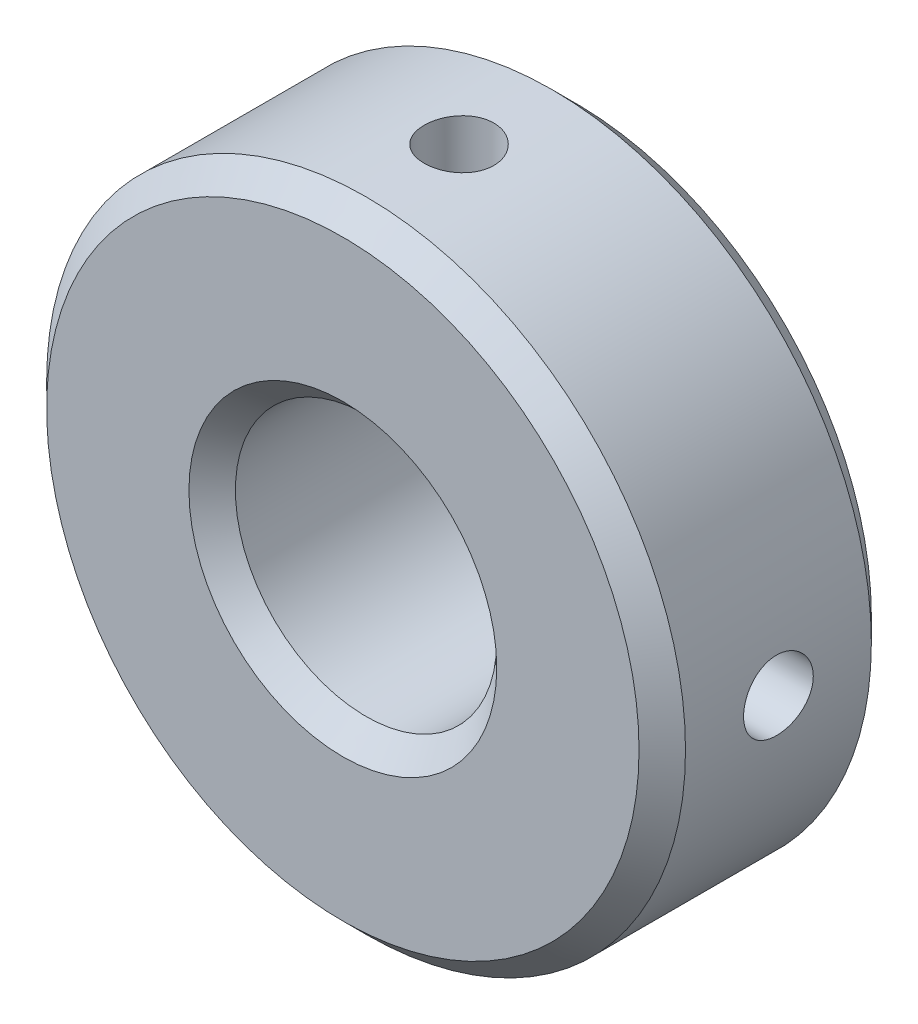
ISO-10303-21;
HEADER;
FILE_DESCRIPTION(('STEP AP214'),'2;1');
FILE_NAME('part.step','',(''),(''),'','','');
FILE_SCHEMA(('AUTOMOTIVE_DESIGN { 1 0 10303 214 1 1 1 1 }'));
ENDSEC;
DATA;
#1=APPLICATION_CONTEXT('core data for automotive mechanical design processes');
#2=APPLICATION_PROTOCOL_DEFINITION('international standard','automotive_design',2000,#1);
#3=PRODUCT_CONTEXT('',#1,'mechanical');
#4=PRODUCT('Part','Part','',(#3));
#5=PRODUCT_RELATED_PRODUCT_CATEGORY('part','',(#4));
#6=PRODUCT_DEFINITION_FORMATION('','',#4);
#7=PRODUCT_DEFINITION_CONTEXT('part definition',#1,'design');
#8=PRODUCT_DEFINITION('design','',#6,#7);
#9=PRODUCT_DEFINITION_SHAPE('','',#8);
#10=(LENGTH_UNIT() NAMED_UNIT(*) SI_UNIT(.MILLI.,.METRE.));
#11=(NAMED_UNIT(*) PLANE_ANGLE_UNIT() SI_UNIT($,.RADIAN.));
#12=(NAMED_UNIT(*) SI_UNIT($,.STERADIAN.) SOLID_ANGLE_UNIT());
#13=UNCERTAINTY_MEASURE_WITH_UNIT(LENGTH_MEASURE(1.E-05),#10,'distance_accuracy_value','');
#14=(GEOMETRIC_REPRESENTATION_CONTEXT(3) GLOBAL_UNCERTAINTY_ASSIGNED_CONTEXT((#13)) GLOBAL_UNIT_ASSIGNED_CONTEXT((#10,
#11,#12)) REPRESENTATION_CONTEXT('',''));
#15=CARTESIAN_POINT('',(0.,0.,0.));
#16=DIRECTION('',(0.,0.,1.));
#17=DIRECTION('',(1.,0.,0.));
#18=AXIS2_PLACEMENT_3D('',#15,#16,#17);
#19=CARTESIAN_POINT('',(0.,0.,-4.));
#20=DIRECTION('',(0.,0.,1.));
#21=DIRECTION('',(1.,0.,0.));
#22=AXIS2_PLACEMENT_3D('',#19,#20,#21);
#23=CYLINDRICAL_SURFACE('',#22,11.);
#24=CARTESIAN_POINT('',(0.,0.,-3.2));
#25=DIRECTION('',(0.,0.,1.));
#26=DIRECTION('',(1.,0.,0.));
#27=AXIS2_PLACEMENT_3D('',#24,#25,#26);
#28=CIRCLE('',#27,11.);
#29=CARTESIAN_POINT('',(11.,0.,-3.2));
#30=VERTEX_POINT('',#29);
#31=EDGE_CURVE('E163',#30,#30,#28,.T.);
#32=ORIENTED_EDGE('',*,*,#31,.T.);
#33=EDGE_LOOP('',(#32));
#34=FACE_BOUND('',#33,.T.);
#35=CARTESIAN_POINT('',(0.,0.,3.2));
#36=DIRECTION('',(0.,0.,1.));
#37=DIRECTION('',(1.,0.,0.));
#38=AXIS2_PLACEMENT_3D('',#35,#36,#37);
#39=CIRCLE('',#38,11.);
#40=CARTESIAN_POINT('',(11.,0.,3.2));
#41=VERTEX_POINT('',#40);
#42=EDGE_CURVE('E155',#41,#41,#39,.F.);
#43=ORIENTED_EDGE('',*,*,#42,.T.);
#44=EDGE_LOOP('',(#43));
#45=FACE_BOUND('',#44,.T.);
#46=CARTESIAN_POINT('',(0.,11.,1.2001011));
#47=CARTESIAN_POINT('',(-0.0671959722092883,10.9999991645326,1.20009820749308));
#48=CARTESIAN_POINT('',(-0.134435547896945,10.9993777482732,1.1944384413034));
#49=CARTESIAN_POINT('',(-0.26704821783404,10.9969585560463,1.17194728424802));
#50=CARTESIAN_POINT('',(-0.332419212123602,10.9951595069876,1.15510380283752));
#51=CARTESIAN_POINT('',(-0.459355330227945,10.9905879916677,1.11074342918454));
#52=CARTESIAN_POINT('',(-0.520922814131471,10.9878161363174,1.08323323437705));
#53=CARTESIAN_POINT('',(-0.638553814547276,10.9816083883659,1.0183339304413));
#54=CARTESIAN_POINT('',(-0.694618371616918,10.9781726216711,0.980946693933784));
#55=CARTESIAN_POINT('',(-0.799902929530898,10.9710051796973,0.897184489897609));
#56=CARTESIAN_POINT('',(-0.849096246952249,10.9672724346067,0.850776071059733));
#57=CARTESIAN_POINT('',(-0.939012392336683,10.9599405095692,0.75036042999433));
#58=CARTESIAN_POINT('',(-0.97973481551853,10.9563413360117,0.696352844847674));
#59=CARTESIAN_POINT('',(-1.0516495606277,10.9496733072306,0.582102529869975));
#60=CARTESIAN_POINT('',(-1.08281741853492,10.9466058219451,0.521844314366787));
#61=CARTESIAN_POINT('',(-1.1345820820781,10.9413620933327,0.396910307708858));
#62=CARTESIAN_POINT('',(-1.15517919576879,10.939185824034,0.332234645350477));
#63=CARTESIAN_POINT('',(-1.18513783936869,10.9359808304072,0.200575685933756));
#64=CARTESIAN_POINT('',(-1.19454394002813,10.9349475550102,0.133602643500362));
#65=CARTESIAN_POINT('',(-1.20199137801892,10.93413149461,-0.000978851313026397));
#66=CARTESIAN_POINT('',(-1.20003306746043,10.9343486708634,-0.0685872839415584));
#67=CARTESIAN_POINT('',(-1.18484395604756,10.936004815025,-0.202212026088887));
#68=CARTESIAN_POINT('',(-1.17166196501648,10.9374384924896,-0.268233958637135));
#69=CARTESIAN_POINT('',(-1.13447569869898,10.9413578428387,-0.397122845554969));
#70=CARTESIAN_POINT('',(-1.11047125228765,10.9438435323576,-0.459989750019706));
#71=CARTESIAN_POINT('',(-1.05226807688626,10.9495928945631,-0.580937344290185));
#72=CARTESIAN_POINT('',(-1.01804784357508,10.9528582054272,-0.639007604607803));
#73=CARTESIAN_POINT('',(-0.940399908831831,10.9597975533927,-0.748599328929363));
#74=CARTESIAN_POINT('',(-0.896971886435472,10.9634716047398,-0.80012056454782));
#75=CARTESIAN_POINT('',(-0.801869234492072,10.9708380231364,-0.895435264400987));
#76=CARTESIAN_POINT('',(-0.750152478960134,10.9745303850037,-0.939186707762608));
#77=CARTESIAN_POINT('',(-0.640086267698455,10.9814992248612,-1.01739368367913));
#78=CARTESIAN_POINT('',(-0.581736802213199,10.9847757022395,-1.05184920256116));
#79=CARTESIAN_POINT('',(-0.460031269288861,10.9905449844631,-1.1104851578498));
#80=CARTESIAN_POINT('',(-0.396674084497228,10.9930376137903,-1.1346632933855));
#81=CARTESIAN_POINT('',(-0.26676606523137,10.9969566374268,-1.17202649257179));
#82=CARTESIAN_POINT('',(-0.200215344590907,10.9983830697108,-1.18521194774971));
#83=CARTESIAN_POINT('',(-0.0661730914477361,11.0000040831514,-1.20016180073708));
#84=CARTESIAN_POINT('',(0.00131190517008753,11.0002049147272,-1.20198415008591));
#85=CARTESIAN_POINT('',(0.135626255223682,10.9993688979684,-1.19430851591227));
#86=CARTESIAN_POINT('',(0.202455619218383,10.9983320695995,-1.18481071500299));
#87=CARTESIAN_POINT('',(0.333393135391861,10.9951411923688,-1.15481248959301));
#88=CARTESIAN_POINT('',(0.397507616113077,10.9929899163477,-1.13433936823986));
#89=CARTESIAN_POINT('',(0.521392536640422,10.9878113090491,-1.08299982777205));
#90=CARTESIAN_POINT('',(0.581162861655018,10.9847839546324,-1.05213313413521));
#91=CARTESIAN_POINT('',(0.694923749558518,10.9781758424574,-0.980740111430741));
#92=CARTESIAN_POINT('',(0.748890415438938,10.9745929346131,-0.94017590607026));
#93=CARTESIAN_POINT('',(0.849269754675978,10.9672821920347,-0.850593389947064));
#94=CARTESIAN_POINT('',(0.895682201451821,10.9635543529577,-0.801574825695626));
#95=CARTESIAN_POINT('',(0.979838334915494,10.9563549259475,-0.696221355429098));
#96=CARTESIAN_POINT('',(1.01754385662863,10.9528845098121,-0.63985587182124));
#97=CARTESIAN_POINT('',(1.0829530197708,10.9466112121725,-0.521558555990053));
#98=CARTESIAN_POINT('',(1.1106568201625,10.9438083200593,-0.459626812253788));
#99=CARTESIAN_POINT('',(1.15521294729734,10.9391949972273,-0.332083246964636));
#100=CARTESIAN_POINT('',(1.17208757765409,10.9373825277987,-0.26647929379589));
#101=CARTESIAN_POINT('',(1.19457855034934,10.9349491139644,-0.133348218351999));
#102=CARTESIAN_POINT('',(1.20019528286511,10.9343281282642,-0.0658211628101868));
#103=CARTESIAN_POINT('',(1.20000501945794,10.934348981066,0.0688598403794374));
#104=CARTESIAN_POINT('',(1.19425797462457,10.9349841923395,0.136013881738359));
#105=CARTESIAN_POINT('',(1.17162941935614,10.9374316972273,0.268396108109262));
#106=CARTESIAN_POINT('',(1.15474789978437,10.9392439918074,0.333624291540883));
#107=CARTESIAN_POINT('',(1.11034691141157,10.9438395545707,0.460300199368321));
#108=CARTESIAN_POINT('',(1.08282959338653,10.9466226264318,0.521748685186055));
#109=CARTESIAN_POINT('',(1.01794415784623,10.9528465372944,0.63916485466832));
#110=CARTESIAN_POINT('',(0.980576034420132,10.9562873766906,0.695132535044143));
#111=CARTESIAN_POINT('',(0.896825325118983,10.9634608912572,0.800305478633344));
#112=CARTESIAN_POINT('',(0.850398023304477,10.96719495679,0.849475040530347));
#113=CARTESIAN_POINT('',(0.749937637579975,10.9745216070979,0.939350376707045));
#114=CARTESIAN_POINT('',(0.695902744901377,10.9781141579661,0.980054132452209));
#115=CARTESIAN_POINT('',(0.581583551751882,10.9847642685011,1.05193981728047));
#116=CARTESIAN_POINT('',(0.52128133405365,10.9878202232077,1.08309338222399));
#117=CARTESIAN_POINT('',(0.396305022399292,10.9930358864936,1.13478981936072));
#118=CARTESIAN_POINT('',(0.331635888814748,10.9951965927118,1.15534450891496));
#119=CARTESIAN_POINT('',(0.222175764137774,10.9978428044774,1.18020336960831));
#120=CARTESIAN_POINT('',(0.178081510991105,10.9986479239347,1.18765464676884));
#121=CARTESIAN_POINT('',(0.089331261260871,10.9997267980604,1.19760446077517));
#122=CARTESIAN_POINT('',(0.0446752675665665,11.0000005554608,1.20010302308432));
#123=CARTESIAN_POINT('',(0.,11.,1.2001011));
#124=B_SPLINE_CURVE_WITH_KNOTS('',3,(#46,#47,#48,#49,#50,#51,#52,#53,#54,#55,#56,#57,#58,#59,
#60,#61,#62,#63,#64,#65,#66,#67,#68,#69,#70,#71,#72,#73,#74,#75,#76,#77,#78,#79,#80,#81,#82,#83,
#84,#85,#86,#87,#88,#89,#90,#91,#92,#93,#94,#95,#96,#97,#98,#99,#100,#101,#102,#103,#104,#105,
#106,#107,#108,#109,#110,#111,#112,#113,#114,#115,#116,#117,#118,#119,#120,#121,#122,#123),
.UNSPECIFIED.,.T.,.F.,(4,2,2,2,2,2,2,2,2,2,2,2,2,2,2,2,2,2,2,2,2,2,2,2,2,2,2,2,2,2,2,2,2,2,2,2,
2,2,4),(0.,0.20142476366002,0.403067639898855,0.604584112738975,0.806062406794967,
1.00830256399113,1.21055238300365,1.41331580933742,1.61607332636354,1.81802058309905,
2.01996158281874,2.22102883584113,2.42209926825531,2.6235959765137,2.82509970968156,
3.02766206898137,3.23022472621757,3.43283270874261,3.63543347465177,3.83700013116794,
4.03856353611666,4.23962782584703,4.44069742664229,4.64256557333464,4.84443977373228,
5.0471827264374,5.24992245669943,5.45224327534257,5.65455708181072,5.85580640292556,
6.05705588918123,6.25826469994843,6.45947363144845,6.66170206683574,6.86397866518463,
7.06685033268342,7.26949531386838,7.40341333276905,7.5373306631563),.UNSPECIFIED.);
#125=CARTESIAN_POINT('',(0.,11.,1.2001011));
#126=VERTEX_POINT('',#125);
#127=EDGE_CURVE('E92',#126,#126,#124,.T.);
#128=ORIENTED_EDGE('',*,*,#127,.T.);
#129=EDGE_LOOP('',(#128));
#130=FACE_BOUND('',#129,.T.);
#131=CARTESIAN_POINT('',(-11.,0.,1.2001011));
#132=CARTESIAN_POINT('',(-10.9999991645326,-0.0671959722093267,1.20009820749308));
#133=CARTESIAN_POINT('',(-10.9993777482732,-0.134435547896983,1.1944384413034));
#134=CARTESIAN_POINT('',(-10.9969585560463,-0.267048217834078,1.17194728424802));
#135=CARTESIAN_POINT('',(-10.9951595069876,-0.332419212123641,1.15510380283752));
#136=CARTESIAN_POINT('',(-10.9905879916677,-0.459355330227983,1.11074342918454));
#137=CARTESIAN_POINT('',(-10.9878161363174,-0.520922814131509,1.08323323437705));
#138=CARTESIAN_POINT('',(-10.9816083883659,-0.638553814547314,1.0183339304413));
#139=CARTESIAN_POINT('',(-10.9781726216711,-0.694618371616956,0.980946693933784));
#140=CARTESIAN_POINT('',(-10.9710051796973,-0.799902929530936,0.89718448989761));
#141=CARTESIAN_POINT('',(-10.9672724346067,-0.849096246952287,0.850776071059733));
#142=CARTESIAN_POINT('',(-10.9599405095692,-0.939012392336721,0.75036042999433));
#143=CARTESIAN_POINT('',(-10.9563413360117,-0.979734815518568,0.696352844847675));
#144=CARTESIAN_POINT('',(-10.9496733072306,-1.05164956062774,0.582102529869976));
#145=CARTESIAN_POINT('',(-10.9466058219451,-1.08281741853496,0.521844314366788));
#146=CARTESIAN_POINT('',(-10.9413620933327,-1.13458208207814,0.396910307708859));
#147=CARTESIAN_POINT('',(-10.939185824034,-1.15517919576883,0.332234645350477));
#148=CARTESIAN_POINT('',(-10.9359808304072,-1.18513783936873,0.200575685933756));
#149=CARTESIAN_POINT('',(-10.9349475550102,-1.19454394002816,0.133602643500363));
#150=CARTESIAN_POINT('',(-10.93413149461,-1.20199137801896,-0.000978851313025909));
#151=CARTESIAN_POINT('',(-10.9343486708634,-1.20003306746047,-0.0685872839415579));
#152=CARTESIAN_POINT('',(-10.9360048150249,-1.1848439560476,-0.202212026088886));
#153=CARTESIAN_POINT('',(-10.9374384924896,-1.17166196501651,-0.268233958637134));
#154=CARTESIAN_POINT('',(-10.9413578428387,-1.13447569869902,-0.397122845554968));
#155=CARTESIAN_POINT('',(-10.9438435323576,-1.11047125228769,-0.459989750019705));
#156=CARTESIAN_POINT('',(-10.9495928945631,-1.0522680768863,-0.580937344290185));
#157=CARTESIAN_POINT('',(-10.9528582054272,-1.01804784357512,-0.639007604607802));
#158=CARTESIAN_POINT('',(-10.9597975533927,-0.94039990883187,-0.748599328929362));
#159=CARTESIAN_POINT('',(-10.9634716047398,-0.896971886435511,-0.800120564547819));
#160=CARTESIAN_POINT('',(-10.9708380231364,-0.801869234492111,-0.895435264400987));
#161=CARTESIAN_POINT('',(-10.9745303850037,-0.750152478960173,-0.939186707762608));
#162=CARTESIAN_POINT('',(-10.9814992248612,-0.640086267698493,-1.01739368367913));
#163=CARTESIAN_POINT('',(-10.9847757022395,-0.581736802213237,-1.05184920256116));
#164=CARTESIAN_POINT('',(-10.9905449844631,-0.460031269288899,-1.1104851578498));
#165=CARTESIAN_POINT('',(-10.9930376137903,-0.396674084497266,-1.1346632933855));
#166=CARTESIAN_POINT('',(-10.9969566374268,-0.266766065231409,-1.17202649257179));
#167=CARTESIAN_POINT('',(-10.9983830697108,-0.200215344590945,-1.18521194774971));
#168=CARTESIAN_POINT('',(-11.0000040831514,-0.0661730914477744,-1.20016180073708));
#169=CARTESIAN_POINT('',(-11.0002049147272,0.00131190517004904,-1.20198415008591));
#170=CARTESIAN_POINT('',(-10.9993688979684,0.135626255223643,-1.19430851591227));
#171=CARTESIAN_POINT('',(-10.9983320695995,0.202455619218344,-1.18481071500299));
#172=CARTESIAN_POINT('',(-10.9951411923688,0.333393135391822,-1.15481248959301));
#173=CARTESIAN_POINT('',(-10.9929899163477,0.397507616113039,-1.13433936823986));
#174=CARTESIAN_POINT('',(-10.9878113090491,0.521392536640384,-1.08299982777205));
#175=CARTESIAN_POINT('',(-10.9847839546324,0.58116286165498,-1.05213313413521));
#176=CARTESIAN_POINT('',(-10.9781758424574,0.69492374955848,-0.980740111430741));
#177=CARTESIAN_POINT('',(-10.9745929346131,0.748890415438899,-0.940175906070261));
#178=CARTESIAN_POINT('',(-10.9672821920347,0.849269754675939,-0.850593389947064));
#179=CARTESIAN_POINT('',(-10.9635543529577,0.895682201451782,-0.801574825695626));
#180=CARTESIAN_POINT('',(-10.9563549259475,0.979838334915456,-0.696221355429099));
#181=CARTESIAN_POINT('',(-10.9528845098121,1.01754385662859,-0.63985587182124));
#182=CARTESIAN_POINT('',(-10.9466112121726,1.08295301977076,-0.521558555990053));
#183=CARTESIAN_POINT('',(-10.9438083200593,1.11065682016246,-0.459626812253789));
#184=CARTESIAN_POINT('',(-10.9391949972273,1.1552129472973,-0.332083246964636));
#185=CARTESIAN_POINT('',(-10.9373825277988,1.17208757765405,-0.26647929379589));
#186=CARTESIAN_POINT('',(-10.9349491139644,1.1945785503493,-0.133348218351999));
#187=CARTESIAN_POINT('',(-10.9343281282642,1.20019528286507,-0.0658211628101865));
#188=CARTESIAN_POINT('',(-10.934348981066,1.20000501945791,0.0688598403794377));
#189=CARTESIAN_POINT('',(-10.9349841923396,1.19425797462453,0.136013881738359));
#190=CARTESIAN_POINT('',(-10.9374316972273,1.1716294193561,0.268396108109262));
#191=CARTESIAN_POINT('',(-10.9392439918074,1.15474789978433,0.333624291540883));
#192=CARTESIAN_POINT('',(-10.9438395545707,1.11034691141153,0.460300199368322));
#193=CARTESIAN_POINT('',(-10.9466226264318,1.08282959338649,0.521748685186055));
#194=CARTESIAN_POINT('',(-10.9528465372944,1.01794415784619,0.63916485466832));
#195=CARTESIAN_POINT('',(-10.9562873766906,0.980576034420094,0.695132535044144));
#196=CARTESIAN_POINT('',(-10.9634608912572,0.896825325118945,0.800305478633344));
#197=CARTESIAN_POINT('',(-10.96719495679,0.850398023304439,0.849475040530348));
#198=CARTESIAN_POINT('',(-10.9745216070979,0.749937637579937,0.939350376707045));
#199=CARTESIAN_POINT('',(-10.9781141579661,0.695902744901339,0.980054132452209));
#200=CARTESIAN_POINT('',(-10.9847642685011,0.581583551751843,1.05193981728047));
#201=CARTESIAN_POINT('',(-10.9878202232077,0.521281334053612,1.08309338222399));
#202=CARTESIAN_POINT('',(-10.9930358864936,0.396305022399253,1.13478981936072));
#203=CARTESIAN_POINT('',(-10.9951965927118,0.33163588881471,1.15534450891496));
#204=CARTESIAN_POINT('',(-10.9978428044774,0.222175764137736,1.18020336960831));
#205=CARTESIAN_POINT('',(-10.9986479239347,0.178081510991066,1.18765464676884));
#206=CARTESIAN_POINT('',(-10.9997267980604,0.0893312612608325,1.19760446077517));
#207=CARTESIAN_POINT('',(-11.0000005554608,0.044675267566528,1.20010302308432));
#208=CARTESIAN_POINT('',(-11.,0.,1.2001011));
#209=B_SPLINE_CURVE_WITH_KNOTS('',3,(#131,#132,#133,#134,#135,#136,#137,#138,#139,#140,#141,
#142,#143,#144,#145,#146,#147,#148,#149,#150,#151,#152,#153,#154,#155,#156,#157,#158,#159,#160,
#161,#162,#163,#164,#165,#166,#167,#168,#169,#170,#171,#172,#173,#174,#175,#176,#177,#178,#179,
#180,#181,#182,#183,#184,#185,#186,#187,#188,#189,#190,#191,#192,#193,#194,#195,#196,#197,#198,
#199,#200,#201,#202,#203,#204,#205,#206,#207,#208),.UNSPECIFIED.,.T.,.F.,(4,2,2,2,2,2,2,2,2,2,2,
2,2,2,2,2,2,2,2,2,2,2,2,2,2,2,2,2,2,2,2,2,2,2,2,2,2,2,4),(0.,0.20142476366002,0.403067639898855,
0.604584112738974,0.806062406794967,1.00830256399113,1.21055238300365,1.41331580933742,
1.61607332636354,1.81802058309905,2.01996158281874,2.22102883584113,2.42209926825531,
2.6235959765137,2.82509970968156,3.02766206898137,3.23022472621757,3.43283270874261,
3.63543347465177,3.83700013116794,4.03856353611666,4.23962782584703,4.44069742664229,
4.64256557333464,4.84443977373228,5.0471827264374,5.24992245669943,5.45224327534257,
5.65455708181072,5.85580640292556,6.05705588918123,6.25826469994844,6.45947363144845,
6.66170206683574,6.86397866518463,7.06685033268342,7.26949531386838,7.40341333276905,
7.5373306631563),.UNSPECIFIED.);
#210=CARTESIAN_POINT('',(-11.,0.,1.2001011));
#211=VERTEX_POINT('',#210);
#212=EDGE_CURVE('E101',#211,#211,#209,.T.);
#213=ORIENTED_EDGE('',*,*,#212,.T.);
#214=EDGE_LOOP('',(#213));
#215=FACE_BOUND('',#214,.T.);
#216=CARTESIAN_POINT('',(0.,-11.,1.2001011));
#217=CARTESIAN_POINT('',(0.0671959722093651,-10.9999991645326,1.20009820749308));
#218=CARTESIAN_POINT('',(0.134435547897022,-10.9993777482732,1.19443844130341));
#219=CARTESIAN_POINT('',(0.267048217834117,-10.9969585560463,1.17194728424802));
#220=CARTESIAN_POINT('',(0.332419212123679,-10.9951595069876,1.15510380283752));
#221=CARTESIAN_POINT('',(0.459355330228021,-10.9905879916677,1.11074342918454));
#222=CARTESIAN_POINT('',(0.520922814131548,-10.9878161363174,1.08323323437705));
#223=CARTESIAN_POINT('',(0.638553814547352,-10.9816083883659,1.0183339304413));
#224=CARTESIAN_POINT('',(0.694618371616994,-10.9781726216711,0.980946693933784));
#225=CARTESIAN_POINT('',(0.799902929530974,-10.9710051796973,0.89718448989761));
#226=CARTESIAN_POINT('',(0.849096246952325,-10.9672724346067,0.850776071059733));
#227=CARTESIAN_POINT('',(0.939012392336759,-10.9599405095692,0.75036042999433));
#228=CARTESIAN_POINT('',(0.979734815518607,-10.9563413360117,0.696352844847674));
#229=CARTESIAN_POINT('',(1.05164956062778,-10.9496733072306,0.582102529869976));
#230=CARTESIAN_POINT('',(1.082817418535,-10.9466058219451,0.521844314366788));
#231=CARTESIAN_POINT('',(1.13458208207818,-10.9413620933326,0.396910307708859));
#232=CARTESIAN_POINT('',(1.15517919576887,-10.939185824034,0.332234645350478));
#233=CARTESIAN_POINT('',(1.18513783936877,-10.9359808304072,0.200575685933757));
#234=CARTESIAN_POINT('',(1.1945439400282,-10.9349475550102,0.133602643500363));
#235=CARTESIAN_POINT('',(1.20199137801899,-10.93413149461,-0.000978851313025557));
#236=CARTESIAN_POINT('',(1.20003306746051,-10.9343486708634,-0.0685872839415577));
#237=CARTESIAN_POINT('',(1.18484395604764,-10.9360048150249,-0.202212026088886));
#238=CARTESIAN_POINT('',(1.17166196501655,-10.9374384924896,-0.268233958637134));
#239=CARTESIAN_POINT('',(1.13447569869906,-10.9413578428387,-0.397122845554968));
#240=CARTESIAN_POINT('',(1.11047125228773,-10.9438435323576,-0.459989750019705));
#241=CARTESIAN_POINT('',(1.05226807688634,-10.9495928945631,-0.580937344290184));
#242=CARTESIAN_POINT('',(1.01804784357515,-10.9528582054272,-0.639007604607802));
#243=CARTESIAN_POINT('',(0.940399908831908,-10.9597975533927,-0.748599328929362));
#244=CARTESIAN_POINT('',(0.896971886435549,-10.9634716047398,-0.800120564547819));
#245=CARTESIAN_POINT('',(0.801869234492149,-10.9708380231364,-0.895435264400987));
#246=CARTESIAN_POINT('',(0.750152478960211,-10.9745303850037,-0.939186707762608));
#247=CARTESIAN_POINT('',(0.640086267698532,-10.9814992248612,-1.01739368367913));
#248=CARTESIAN_POINT('',(0.581736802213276,-10.9847757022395,-1.05184920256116));
#249=CARTESIAN_POINT('',(0.460031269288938,-10.9905449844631,-1.1104851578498));
#250=CARTESIAN_POINT('',(0.396674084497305,-10.9930376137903,-1.1346632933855));
#251=CARTESIAN_POINT('',(0.266766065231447,-10.9969566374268,-1.17202649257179));
#252=CARTESIAN_POINT('',(0.200215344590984,-10.9983830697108,-1.18521194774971));
#253=CARTESIAN_POINT('',(0.0661730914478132,-11.0000040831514,-1.20016180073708));
#254=CARTESIAN_POINT('',(-0.00131190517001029,-11.0002049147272,-1.20198415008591));
#255=CARTESIAN_POINT('',(-0.135626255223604,-10.9993688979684,-1.19430851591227));
#256=CARTESIAN_POINT('',(-0.202455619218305,-10.9983320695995,-1.18481071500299));
#257=CARTESIAN_POINT('',(-0.333393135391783,-10.9951411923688,-1.15481248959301));
#258=CARTESIAN_POINT('',(-0.397507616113,-10.9929899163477,-1.13433936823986));
#259=CARTESIAN_POINT('',(-0.521392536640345,-10.9878113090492,-1.08299982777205));
#260=CARTESIAN_POINT('',(-0.581162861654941,-10.9847839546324,-1.05213313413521));
#261=CARTESIAN_POINT('',(-0.694923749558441,-10.9781758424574,-0.980740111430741));
#262=CARTESIAN_POINT('',(-0.748890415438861,-10.9745929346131,-0.94017590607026));
#263=CARTESIAN_POINT('',(-0.849269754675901,-10.9672821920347,-0.850593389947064));
#264=CARTESIAN_POINT('',(-0.895682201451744,-10.9635543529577,-0.801574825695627));
#265=CARTESIAN_POINT('',(-0.979838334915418,-10.9563549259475,-0.696221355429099));
#266=CARTESIAN_POINT('',(-1.01754385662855,-10.9528845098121,-0.63985587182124));
#267=CARTESIAN_POINT('',(-1.08295301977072,-10.9466112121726,-0.521558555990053));
#268=CARTESIAN_POINT('',(-1.11065682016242,-10.9438083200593,-0.459626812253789));
#269=CARTESIAN_POINT('',(-1.15521294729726,-10.9391949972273,-0.332083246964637));
#270=CARTESIAN_POINT('',(-1.17208757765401,-10.9373825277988,-0.26647929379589));
#271=CARTESIAN_POINT('',(-1.19457855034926,-10.9349491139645,-0.133348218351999));
#272=CARTESIAN_POINT('',(-1.20019528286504,-10.9343281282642,-0.0658211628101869));
#273=CARTESIAN_POINT('',(-1.20000501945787,-10.934348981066,0.0688598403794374));
#274=CARTESIAN_POINT('',(-1.1942579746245,-10.9349841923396,0.136013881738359));
#275=CARTESIAN_POINT('',(-1.17162941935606,-10.9374316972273,0.268396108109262));
#276=CARTESIAN_POINT('',(-1.1547478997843,-10.9392439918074,0.333624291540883));
#277=CARTESIAN_POINT('',(-1.11034691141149,-10.9438395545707,0.460300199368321));
#278=CARTESIAN_POINT('',(-1.08282959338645,-10.9466226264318,0.521748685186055));
#279=CARTESIAN_POINT('',(-1.01794415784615,-10.9528465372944,0.63916485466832));
#280=CARTESIAN_POINT('',(-0.980576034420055,-10.9562873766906,0.695132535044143));
#281=CARTESIAN_POINT('',(-0.896825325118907,-10.9634608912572,0.800305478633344));
#282=CARTESIAN_POINT('',(-0.850398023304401,-10.96719495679,0.849475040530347));
#283=CARTESIAN_POINT('',(-0.749937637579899,-10.9745216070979,0.939350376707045));
#284=CARTESIAN_POINT('',(-0.695902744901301,-10.9781141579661,0.980054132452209));
#285=CARTESIAN_POINT('',(-0.581583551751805,-10.9847642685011,1.05193981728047));
#286=CARTESIAN_POINT('',(-0.521281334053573,-10.9878202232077,1.08309338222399));
#287=CARTESIAN_POINT('',(-0.396305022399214,-10.9930358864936,1.13478981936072));
#288=CARTESIAN_POINT('',(-0.331635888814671,-10.9951965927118,1.15534450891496));
#289=CARTESIAN_POINT('',(-0.222175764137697,-10.9978428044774,1.18020336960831));
#290=CARTESIAN_POINT('',(-0.178081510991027,-10.9986479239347,1.18765464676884));
#291=CARTESIAN_POINT('',(-0.0893312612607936,-10.9997267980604,1.19760446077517));
#292=CARTESIAN_POINT('',(-0.0446752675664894,-11.0000005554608,1.20010302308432));
#293=CARTESIAN_POINT('',(0.,-11.,1.2001011));
#294=B_SPLINE_CURVE_WITH_KNOTS('',3,(#216,#217,#218,#219,#220,#221,#222,#223,#224,#225,#226,
#227,#228,#229,#230,#231,#232,#233,#234,#235,#236,#237,#238,#239,#240,#241,#242,#243,#244,#245,
#246,#247,#248,#249,#250,#251,#252,#253,#254,#255,#256,#257,#258,#259,#260,#261,#262,#263,#264,
#265,#266,#267,#268,#269,#270,#271,#272,#273,#274,#275,#276,#277,#278,#279,#280,#281,#282,#283,
#284,#285,#286,#287,#288,#289,#290,#291,#292,#293),.UNSPECIFIED.,.T.,.F.,(4,2,2,2,2,2,2,2,2,2,2,
2,2,2,2,2,2,2,2,2,2,2,2,2,2,2,2,2,2,2,2,2,2,2,2,2,2,2,4),(0.,0.20142476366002,0.403067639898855,
0.604584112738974,0.806062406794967,1.00830256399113,1.21055238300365,1.41331580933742,
1.61607332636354,1.81802058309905,2.01996158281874,2.22102883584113,2.42209926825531,
2.6235959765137,2.82509970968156,3.02766206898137,3.23022472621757,3.43283270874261,
3.63543347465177,3.83700013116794,4.03856353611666,4.23962782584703,4.4406974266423,
4.64256557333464,4.84443977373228,5.0471827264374,5.24992245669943,5.45224327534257,
5.65455708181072,5.85580640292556,6.05705588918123,6.25826469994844,6.45947363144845,
6.66170206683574,6.86397866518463,7.06685033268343,7.26949531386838,7.40341333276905,
7.5373306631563),.UNSPECIFIED.);
#295=CARTESIAN_POINT('',(0.,-11.,1.2001011));
#296=VERTEX_POINT('',#295);
#297=EDGE_CURVE('E107',#296,#296,#294,.T.);
#298=ORIENTED_EDGE('',*,*,#297,.T.);
#299=EDGE_LOOP('',(#298));
#300=FACE_BOUND('',#299,.T.);
#301=CARTESIAN_POINT('',(11.,1.15218884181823E-13,1.2001011));
#302=CARTESIAN_POINT('',(10.9999991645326,0.0671959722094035,1.20009820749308));
#303=CARTESIAN_POINT('',(10.9993777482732,0.13443554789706,1.19443844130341));
#304=CARTESIAN_POINT('',(10.9969585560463,0.267048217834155,1.17194728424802));
#305=CARTESIAN_POINT('',(10.9951595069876,0.332419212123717,1.15510380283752));
#306=CARTESIAN_POINT('',(10.9905879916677,0.459355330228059,1.11074342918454));
#307=CARTESIAN_POINT('',(10.9878161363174,0.520922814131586,1.08323323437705));
#308=CARTESIAN_POINT('',(10.9816083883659,0.63855381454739,1.0183339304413));
#309=CARTESIAN_POINT('',(10.9781726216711,0.694618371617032,0.980946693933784));
#310=CARTESIAN_POINT('',(10.9710051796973,0.799902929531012,0.89718448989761));
#311=CARTESIAN_POINT('',(10.9672724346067,0.849096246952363,0.850776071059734));
#312=CARTESIAN_POINT('',(10.9599405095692,0.939012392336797,0.75036042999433));
#313=CARTESIAN_POINT('',(10.9563413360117,0.979734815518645,0.696352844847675));
#314=CARTESIAN_POINT('',(10.9496733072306,1.05164956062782,0.582102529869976));
#315=CARTESIAN_POINT('',(10.9466058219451,1.08281741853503,0.521844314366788));
#316=CARTESIAN_POINT('',(10.9413620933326,1.13458208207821,0.396910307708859));
#317=CARTESIAN_POINT('',(10.939185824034,1.1551791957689,0.332234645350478));
#318=CARTESIAN_POINT('',(10.9359808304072,1.18513783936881,0.200575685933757));
#319=CARTESIAN_POINT('',(10.9349475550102,1.19454394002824,0.133602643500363));
#320=CARTESIAN_POINT('',(10.93413149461,1.20199137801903,-0.000978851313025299));
#321=CARTESIAN_POINT('',(10.9343486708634,1.20003306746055,-0.0685872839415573));
#322=CARTESIAN_POINT('',(10.9360048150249,1.18484395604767,-0.202212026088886));
#323=CARTESIAN_POINT('',(10.9374384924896,1.17166196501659,-0.268233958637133));
#324=CARTESIAN_POINT('',(10.9413578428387,1.1344756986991,-0.397122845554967));
#325=CARTESIAN_POINT('',(10.9438435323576,1.11047125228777,-0.459989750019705));
#326=CARTESIAN_POINT('',(10.9495928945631,1.05226807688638,-0.580937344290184));
#327=CARTESIAN_POINT('',(10.9528582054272,1.01804784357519,-0.639007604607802));
#328=CARTESIAN_POINT('',(10.9597975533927,0.940399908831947,-0.748599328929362));
#329=CARTESIAN_POINT('',(10.9634716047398,0.896971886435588,-0.800120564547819));
#330=CARTESIAN_POINT('',(10.9708380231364,0.801869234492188,-0.895435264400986));
#331=CARTESIAN_POINT('',(10.9745303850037,0.75015247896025,-0.939186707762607));
#332=CARTESIAN_POINT('',(10.9814992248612,0.640086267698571,-1.01739368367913));
#333=CARTESIAN_POINT('',(10.9847757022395,0.581736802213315,-1.05184920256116));
#334=CARTESIAN_POINT('',(10.9905449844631,0.460031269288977,-1.1104851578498));
#335=CARTESIAN_POINT('',(10.9930376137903,0.396674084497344,-1.1346632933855));
#336=CARTESIAN_POINT('',(10.9969566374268,0.266766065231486,-1.17202649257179));
#337=CARTESIAN_POINT('',(10.9983830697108,0.200215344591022,-1.18521194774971));
#338=CARTESIAN_POINT('',(11.0000040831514,0.0661730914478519,-1.20016180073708));
#339=CARTESIAN_POINT('',(11.0002049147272,-0.00131190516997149,-1.20198415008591));
#340=CARTESIAN_POINT('',(10.9993688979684,-0.135626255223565,-1.19430851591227));
#341=CARTESIAN_POINT('',(10.9983320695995,-0.202455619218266,-1.18481071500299));
#342=CARTESIAN_POINT('',(10.9951411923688,-0.333393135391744,-1.15481248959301));
#343=CARTESIAN_POINT('',(10.9929899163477,-0.39750761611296,-1.13433936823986));
#344=CARTESIAN_POINT('',(10.9878113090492,-0.521392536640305,-1.08299982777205));
#345=CARTESIAN_POINT('',(10.9847839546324,-0.581162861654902,-1.05213313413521));
#346=CARTESIAN_POINT('',(10.9781758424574,-0.694923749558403,-0.980740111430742));
#347=CARTESIAN_POINT('',(10.9745929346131,-0.748890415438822,-0.940175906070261));
#348=CARTESIAN_POINT('',(10.9672821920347,-0.849269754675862,-0.850593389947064));
#349=CARTESIAN_POINT('',(10.9635543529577,-0.895682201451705,-0.801574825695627));
#350=CARTESIAN_POINT('',(10.9563549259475,-0.979838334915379,-0.6962213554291));
#351=CARTESIAN_POINT('',(10.9528845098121,-1.01754385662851,-0.639855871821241));
#352=CARTESIAN_POINT('',(10.9466112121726,-1.08295301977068,-0.521558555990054));
#353=CARTESIAN_POINT('',(10.9438083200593,-1.11065682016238,-0.45962681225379));
#354=CARTESIAN_POINT('',(10.9391949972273,-1.15521294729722,-0.332083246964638));
#355=CARTESIAN_POINT('',(10.9373825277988,-1.17208757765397,-0.266479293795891));
#356=CARTESIAN_POINT('',(10.9349491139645,-1.19457855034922,-0.133348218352));
#357=CARTESIAN_POINT('',(10.9343281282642,-1.200195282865,-0.0658211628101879));
#358=CARTESIAN_POINT('',(10.934348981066,-1.20000501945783,0.0688598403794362));
#359=CARTESIAN_POINT('',(10.9349841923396,-1.19425797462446,0.136013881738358));
#360=CARTESIAN_POINT('',(10.9374316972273,-1.17162941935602,0.268396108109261));
#361=CARTESIAN_POINT('',(10.9392439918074,-1.15474789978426,0.333624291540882));
#362=CARTESIAN_POINT('',(10.9438395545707,-1.11034691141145,0.460300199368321));
#363=CARTESIAN_POINT('',(10.9466226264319,-1.08282959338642,0.521748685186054));
#364=CARTESIAN_POINT('',(10.9528465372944,-1.01794415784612,0.639164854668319));
#365=CARTESIAN_POINT('',(10.9562873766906,-0.980576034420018,0.695132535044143));
#366=CARTESIAN_POINT('',(10.9634608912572,-0.896825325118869,0.800305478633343));
#367=CARTESIAN_POINT('',(10.96719495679,-0.850398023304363,0.849475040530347));
#368=CARTESIAN_POINT('',(10.9745216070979,-0.749937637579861,0.939350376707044));
#369=CARTESIAN_POINT('',(10.9781141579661,-0.695902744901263,0.980054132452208));
#370=CARTESIAN_POINT('',(10.9847642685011,-0.581583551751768,1.05193981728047));
#371=CARTESIAN_POINT('',(10.9878202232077,-0.521281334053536,1.08309338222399));
#372=CARTESIAN_POINT('',(10.9930358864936,-0.396305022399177,1.13478981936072));
#373=CARTESIAN_POINT('',(10.9951965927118,-0.331635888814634,1.15534450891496));
#374=CARTESIAN_POINT('',(10.9978428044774,-0.22217576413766,1.18020336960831));
#375=CARTESIAN_POINT('',(10.9986479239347,-0.17808151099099,1.18765464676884));
#376=CARTESIAN_POINT('',(10.9997267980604,-0.0893312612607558,1.19760446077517));
#377=CARTESIAN_POINT('',(11.0000005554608,-0.0446752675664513,1.20010302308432));
#378=CARTESIAN_POINT('',(11.,1.15218884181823E-13,1.2001011));
#379=B_SPLINE_CURVE_WITH_KNOTS('',3,(#301,#302,#303,#304,#305,#306,#307,#308,#309,#310,#311,
#312,#313,#314,#315,#316,#317,#318,#319,#320,#321,#322,#323,#324,#325,#326,#327,#328,#329,#330,
#331,#332,#333,#334,#335,#336,#337,#338,#339,#340,#341,#342,#343,#344,#345,#346,#347,#348,#349,
#350,#351,#352,#353,#354,#355,#356,#357,#358,#359,#360,#361,#362,#363,#364,#365,#366,#367,#368,
#369,#370,#371,#372,#373,#374,#375,#376,#377,#378),.UNSPECIFIED.,.T.,.F.,(4,2,2,2,2,2,2,2,2,2,2,
2,2,2,2,2,2,2,2,2,2,2,2,2,2,2,2,2,2,2,2,2,2,2,2,2,2,2,4),(0.,0.20142476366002,0.403067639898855,
0.604584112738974,0.806062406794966,1.00830256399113,1.21055238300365,1.41331580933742,
1.61607332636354,1.81802058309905,2.01996158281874,2.22102883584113,2.42209926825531,
2.6235959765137,2.82509970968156,3.02766206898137,3.23022472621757,3.43283270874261,
3.63543347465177,3.83700013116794,4.03856353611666,4.23962782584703,4.44069742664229,
4.64256557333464,4.84443977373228,5.0471827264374,5.24992245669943,5.45224327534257,
5.65455708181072,5.85580640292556,6.05705588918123,6.25826469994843,6.45947363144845,
6.66170206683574,6.86397866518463,7.06685033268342,7.26949531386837,7.40341333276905,
7.5373306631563),.UNSPECIFIED.);
#380=CARTESIAN_POINT('',(11.,1.15218884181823E-13,1.2001011));
#381=VERTEX_POINT('',#380);
#382=EDGE_CURVE('E112',#381,#381,#379,.T.);
#383=ORIENTED_EDGE('',*,*,#382,.T.);
#384=EDGE_LOOP('',(#383));
#385=FACE_BOUND('',#384,.T.);
#386=ADVANCED_FACE('F35',(#34,#45,#130,#215,#300,#385),#23,.T.);
#387=CARTESIAN_POINT('',(0.,0.,-4.));
#388=DIRECTION('',(0.,0.,1.));
#389=DIRECTION('',(1.,0.,0.));
#390=AXIS2_PLACEMENT_3D('',#387,#388,#389);
#391=PLANE('',#390);
#392=CARTESIAN_POINT('',(0.,0.,-4.));
#393=DIRECTION('',(0.,0.,1.));
#394=DIRECTION('',(1.,0.,0.));
#395=AXIS2_PLACEMENT_3D('',#392,#393,#394);
#396=CIRCLE('',#395,5.3);
#397=CARTESIAN_POINT('',(5.3,0.,-4.));
#398=VERTEX_POINT('',#397);
#399=EDGE_CURVE('E153',#398,#398,#396,.T.);
#400=ORIENTED_EDGE('',*,*,#399,.T.);
#401=EDGE_LOOP('',(#400));
#402=FACE_BOUND('',#401,.T.);
#403=CARTESIAN_POINT('',(0.,0.,-4.));
#404=DIRECTION('',(0.,0.,1.));
#405=DIRECTION('',(1.,0.,0.));
#406=AXIS2_PLACEMENT_3D('',#403,#404,#405);
#407=CIRCLE('',#406,10.2);
#408=CARTESIAN_POINT('',(10.2,0.,-4.));
#409=VERTEX_POINT('',#408);
#410=EDGE_CURVE('E158',#409,#409,#407,.F.);
#411=ORIENTED_EDGE('',*,*,#410,.T.);
#412=EDGE_LOOP('',(#411));
#413=FACE_BOUND('',#412,.T.);
#414=ADVANCED_FACE('F74',(#402,#413),#391,.F.);
#415=CARTESIAN_POINT('',(0.,0.,4.));
#416=DIRECTION('',(0.,0.,1.));
#417=DIRECTION('',(1.,0.,0.));
#418=AXIS2_PLACEMENT_3D('',#415,#416,#417);
#419=PLANE('',#418);
#420=CARTESIAN_POINT('',(0.,0.,4.));
#421=DIRECTION('',(0.,0.,1.));
#422=DIRECTION('',(1.,0.,0.));
#423=AXIS2_PLACEMENT_3D('',#420,#421,#422);
#424=CIRCLE('',#423,5.30000000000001);
#425=CARTESIAN_POINT('',(5.30000000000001,0.,4.));
#426=VERTEX_POINT('',#425);
#427=EDGE_CURVE('E11',#426,#426,#424,.F.);
#428=ORIENTED_EDGE('',*,*,#427,.T.);
#429=EDGE_LOOP('',(#428));
#430=FACE_BOUND('',#429,.T.);
#431=CARTESIAN_POINT('',(0.,0.,4.));
#432=DIRECTION('',(0.,0.,1.));
#433=DIRECTION('',(1.,0.,0.));
#434=AXIS2_PLACEMENT_3D('',#431,#432,#433);
#435=CIRCLE('',#434,10.2);
#436=CARTESIAN_POINT('',(10.2,0.,4.));
#437=VERTEX_POINT('',#436);
#438=EDGE_CURVE('E43',#437,#437,#435,.T.);
#439=ORIENTED_EDGE('',*,*,#438,.T.);
#440=EDGE_LOOP('',(#439));
#441=FACE_BOUND('',#440,.T.);
#442=ADVANCED_FACE('F80',(#430,#441),#419,.T.);
#443=CARTESIAN_POINT('',(0.,0.,-4.));
#444=DIRECTION('',(0.,0.,1.));
#445=DIRECTION('',(1.,0.,0.));
#446=AXIS2_PLACEMENT_3D('',#443,#444,#445);
#447=CYLINDRICAL_SURFACE('',#446,4.5);
#448=CARTESIAN_POINT('',(0.,0.,-3.2));
#449=DIRECTION('',(0.,0.,1.));
#450=DIRECTION('',(1.,0.,0.));
#451=AXIS2_PLACEMENT_3D('',#448,#449,#450);
#452=CIRCLE('',#451,4.5);
#453=CARTESIAN_POINT('',(4.5,0.,-3.2));
#454=VERTEX_POINT('',#453);
#455=EDGE_CURVE('E148',#454,#454,#452,.F.);
#456=ORIENTED_EDGE('',*,*,#455,.T.);
#457=EDGE_LOOP('',(#456));
#458=FACE_BOUND('',#457,.T.);
#459=CARTESIAN_POINT('',(0.,0.,3.2));
#460=DIRECTION('',(0.,0.,1.));
#461=DIRECTION('',(1.,0.,0.));
#462=AXIS2_PLACEMENT_3D('',#459,#460,#461);
#463=CIRCLE('',#462,4.5);
#464=CARTESIAN_POINT('',(4.5,0.,3.2));
#465=VERTEX_POINT('',#464);
#466=EDGE_CURVE('E151',#465,#465,#463,.T.);
#467=ORIENTED_EDGE('',*,*,#466,.T.);
#468=EDGE_LOOP('',(#467));
#469=FACE_BOUND('',#468,.T.);
#470=ADVANCED_FACE('F137',(#458,#469),#447,.F.);
#471=CARTESIAN_POINT('',(0.,6.91766308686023,0.));
#472=DIRECTION('',(0.,1.,0.));
#473=DIRECTION('',(0.,0.,1.));
#474=AXIS2_PLACEMENT_3D('',#471,#472,#473);
#475=CONICAL_SURFACE('',#474,0.,1.04719755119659);
#476=CARTESIAN_POINT('',(0.,7.61054178,0.));
#477=DIRECTION('',(0.,1.,0.));
#478=DIRECTION('',(0.,0.,1.));
#479=AXIS2_PLACEMENT_3D('',#476,#477,#478);
#480=CIRCLE('',#479,1.2001011);
#481=CARTESIAN_POINT('',(0.,7.61054178,1.2001011));
#482=VERTEX_POINT('',#481);
#483=EDGE_CURVE('E311',#482,#482,#480,.T.);
#484=ORIENTED_EDGE('',*,*,#483,.T.);
#485=EDGE_LOOP('',(#484));
#486=FACE_BOUND('',#485,.T.);
#487=CARTESIAN_POINT('',(0.,6.91766308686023,0.));
#488=VERTEX_POINT('',#487);
#489=VERTEX_LOOP('',#488);
#490=FACE_BOUND('',#489,.T.);
#491=ADVANCED_FACE('F133',(#486,#490),#475,.F.);
#492=CARTESIAN_POINT('',(0.,14.6090267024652,0.));
#493=DIRECTION('',(0.,1.,0.));
#494=DIRECTION('',(0.,0.,1.));
#495=AXIS2_PLACEMENT_3D('',#492,#493,#494);
#496=CYLINDRICAL_SURFACE('',#495,1.2001011);
#497=ORIENTED_EDGE('',*,*,#127,.F.);
#498=EDGE_LOOP('',(#497));
#499=FACE_BOUND('',#498,.T.);
#500=ORIENTED_EDGE('',*,*,#483,.F.);
#501=EDGE_LOOP('',(#500));
#502=FACE_BOUND('',#501,.T.);
#503=ADVANCED_FACE('F128',(#499,#502),#496,.F.);
#504=CARTESIAN_POINT('',(-6.91766308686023,0.,0.));
#505=DIRECTION('',(-1.,0.,0.));
#506=DIRECTION('',(0.,0.,1.));
#507=AXIS2_PLACEMENT_3D('',#504,#505,#506);
#508=CONICAL_SURFACE('',#507,0.,1.04719755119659);
#509=CARTESIAN_POINT('',(-7.61054178,0.,0.));
#510=DIRECTION('',(-1.,0.,0.));
#511=DIRECTION('',(0.,0.,1.));
#512=AXIS2_PLACEMENT_3D('',#509,#510,#511);
#513=CIRCLE('',#512,1.2001011);
#514=CARTESIAN_POINT('',(-7.61054178,0.,1.2001011));
#515=VERTEX_POINT('',#514);
#516=EDGE_CURVE('E307',#515,#515,#513,.T.);
#517=ORIENTED_EDGE('',*,*,#516,.T.);
#518=EDGE_LOOP('',(#517));
#519=FACE_BOUND('',#518,.T.);
#520=CARTESIAN_POINT('',(-6.91766308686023,0.,0.));
#521=VERTEX_POINT('',#520);
#522=VERTEX_LOOP('',#521);
#523=FACE_BOUND('',#522,.T.);
#524=ADVANCED_FACE('F125',(#519,#523),#508,.F.);
#525=CARTESIAN_POINT('',(-14.6090267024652,0.,0.));
#526=DIRECTION('',(-1.,0.,0.));
#527=DIRECTION('',(0.,0.,1.));
#528=AXIS2_PLACEMENT_3D('',#525,#526,#527);
#529=CYLINDRICAL_SURFACE('',#528,1.2001011);
#530=ORIENTED_EDGE('',*,*,#212,.F.);
#531=EDGE_LOOP('',(#530));
#532=FACE_BOUND('',#531,.T.);
#533=ORIENTED_EDGE('',*,*,#516,.F.);
#534=EDGE_LOOP('',(#533));
#535=FACE_BOUND('',#534,.T.);
#536=ADVANCED_FACE('F120',(#532,#535),#529,.F.);
#537=CARTESIAN_POINT('',(0.,-6.91766308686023,0.));
#538=DIRECTION('',(0.,-1.,0.));
#539=DIRECTION('',(0.,0.,1.));
#540=AXIS2_PLACEMENT_3D('',#537,#538,#539);
#541=CONICAL_SURFACE('',#540,0.,1.04719755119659);
#542=CARTESIAN_POINT('',(0.,-7.61054178,0.));
#543=DIRECTION('',(0.,-1.,0.));
#544=DIRECTION('',(0.,0.,1.));
#545=AXIS2_PLACEMENT_3D('',#542,#543,#544);
#546=CIRCLE('',#545,1.2001011);
#547=CARTESIAN_POINT('',(0.,-7.61054178,1.2001011));
#548=VERTEX_POINT('',#547);
#549=EDGE_CURVE('E304',#548,#548,#546,.T.);
#550=ORIENTED_EDGE('',*,*,#549,.T.);
#551=EDGE_LOOP('',(#550));
#552=FACE_BOUND('',#551,.T.);
#553=CARTESIAN_POINT('',(0.,-6.91766308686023,0.));
#554=VERTEX_POINT('',#553);
#555=VERTEX_LOOP('',#554);
#556=FACE_BOUND('',#555,.T.);
#557=ADVANCED_FACE('F69',(#552,#556),#541,.F.);
#558=CARTESIAN_POINT('',(1.02014288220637E-13,-14.6090267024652,0.));
#559=DIRECTION('',(0.,-1.,0.));
#560=DIRECTION('',(0.,0.,1.));
#561=AXIS2_PLACEMENT_3D('',#558,#559,#560);
#562=CYLINDRICAL_SURFACE('',#561,1.2001011);
#563=ORIENTED_EDGE('',*,*,#297,.F.);
#564=EDGE_LOOP('',(#563));
#565=FACE_BOUND('',#564,.T.);
#566=ORIENTED_EDGE('',*,*,#549,.F.);
#567=EDGE_LOOP('',(#566));
#568=FACE_BOUND('',#567,.T.);
#569=ADVANCED_FACE('F59',(#565,#568),#562,.F.);
#570=CARTESIAN_POINT('',(6.91766308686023,0.,0.));
#571=DIRECTION('',(1.,0.,0.));
#572=DIRECTION('',(0.,0.,1.));
#573=AXIS2_PLACEMENT_3D('',#570,#571,#572);
#574=CONICAL_SURFACE('',#573,0.,1.04719755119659);
#575=CARTESIAN_POINT('',(7.61054178,0.,0.));
#576=DIRECTION('',(1.,0.,0.));
#577=DIRECTION('',(0.,0.,1.));
#578=AXIS2_PLACEMENT_3D('',#575,#576,#577);
#579=CIRCLE('',#578,1.2001011);
#580=CARTESIAN_POINT('',(7.61054178,0.,1.2001011));
#581=VERTEX_POINT('',#580);
#582=EDGE_CURVE('E303',#581,#581,#579,.T.);
#583=ORIENTED_EDGE('',*,*,#582,.T.);
#584=EDGE_LOOP('',(#583));
#585=FACE_BOUND('',#584,.T.);
#586=CARTESIAN_POINT('',(6.91766308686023,0.,0.));
#587=VERTEX_POINT('',#586);
#588=VERTEX_LOOP('',#587);
#589=FACE_BOUND('',#588,.T.);
#590=ADVANCED_FACE('F56',(#585,#589),#574,.F.);
#591=CARTESIAN_POINT('',(14.6090267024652,1.53021432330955E-13,0.));
#592=DIRECTION('',(1.,0.,0.));
#593=DIRECTION('',(0.,0.,1.));
#594=AXIS2_PLACEMENT_3D('',#591,#592,#593);
#595=CYLINDRICAL_SURFACE('',#594,1.2001011);
#596=ORIENTED_EDGE('',*,*,#382,.F.);
#597=EDGE_LOOP('',(#596));
#598=FACE_BOUND('',#597,.T.);
#599=ORIENTED_EDGE('',*,*,#582,.F.);
#600=EDGE_LOOP('',(#599));
#601=FACE_BOUND('',#600,.T.);
#602=ADVANCED_FACE('F58',(#598,#601),#595,.F.);
#603=CARTESIAN_POINT('',(0.,0.,-4.));
#604=DIRECTION('',(0.,0.,-1.));
#605=DIRECTION('',(-1.,0.,0.));
#606=AXIS2_PLACEMENT_3D('',#603,#604,#605);
#607=CONICAL_SURFACE('',#606,5.3,0.785398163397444);
#608=ORIENTED_EDGE('',*,*,#455,.F.);
#609=EDGE_LOOP('',(#608));
#610=FACE_BOUND('',#609,.T.);
#611=ORIENTED_EDGE('',*,*,#399,.F.);
#612=EDGE_LOOP('',(#611));
#613=FACE_BOUND('',#612,.T.);
#614=ADVANCED_FACE('F66',(#610,#613),#607,.F.);
#615=CARTESIAN_POINT('',(0.,0.,-3.2));
#616=DIRECTION('',(0.,0.,1.));
#617=DIRECTION('',(1.,0.,0.));
#618=AXIS2_PLACEMENT_3D('',#615,#616,#617);
#619=CONICAL_SURFACE('',#618,11.,0.785398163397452);
#620=ORIENTED_EDGE('',*,*,#410,.F.);
#621=EDGE_LOOP('',(#620));
#622=FACE_BOUND('',#621,.T.);
#623=ORIENTED_EDGE('',*,*,#31,.F.);
#624=EDGE_LOOP('',(#623));
#625=FACE_BOUND('',#624,.T.);
#626=ADVANCED_FACE('F174',(#622,#625),#619,.T.);
#627=CARTESIAN_POINT('',(0.,0.,3.2));
#628=DIRECTION('',(0.,0.,1.));
#629=DIRECTION('',(1.,0.,0.));
#630=AXIS2_PLACEMENT_3D('',#627,#628,#629);
#631=CONICAL_SURFACE('',#630,4.5,0.78539816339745);
#632=ORIENTED_EDGE('',*,*,#427,.F.);
#633=EDGE_LOOP('',(#632));
#634=FACE_BOUND('',#633,.T.);
#635=ORIENTED_EDGE('',*,*,#466,.F.);
#636=EDGE_LOOP('',(#635));
#637=FACE_BOUND('',#636,.T.);
#638=ADVANCED_FACE('F169',(#634,#637),#631,.F.);
#639=CARTESIAN_POINT('',(0.,0.,4.));
#640=DIRECTION('',(0.,0.,-1.));
#641=DIRECTION('',(-1.,0.,0.));
#642=AXIS2_PLACEMENT_3D('',#639,#640,#641);
#643=CONICAL_SURFACE('',#642,10.2,0.785398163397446);
#644=ORIENTED_EDGE('',*,*,#42,.F.);
#645=EDGE_LOOP('',(#644));
#646=FACE_BOUND('',#645,.T.);
#647=ORIENTED_EDGE('',*,*,#438,.F.);
#648=EDGE_LOOP('',(#647));
#649=FACE_BOUND('',#648,.T.);
#650=ADVANCED_FACE('F37',(#646,#649),#643,.T.);
#651=CLOSED_SHELL('',(#386,#414,#442,#470,#491,#503,#524,#536,#557,#569,#590,#602,#614,#626,
#638,#650));
#652=MANIFOLD_SOLID_BREP('B2',#651);
#653=ADVANCED_BREP_SHAPE_REPRESENTATION('',(#18,#652),#14);
#654=SHAPE_DEFINITION_REPRESENTATION(#9,#653);
ENDSEC;
END-ISO-10303-21;
